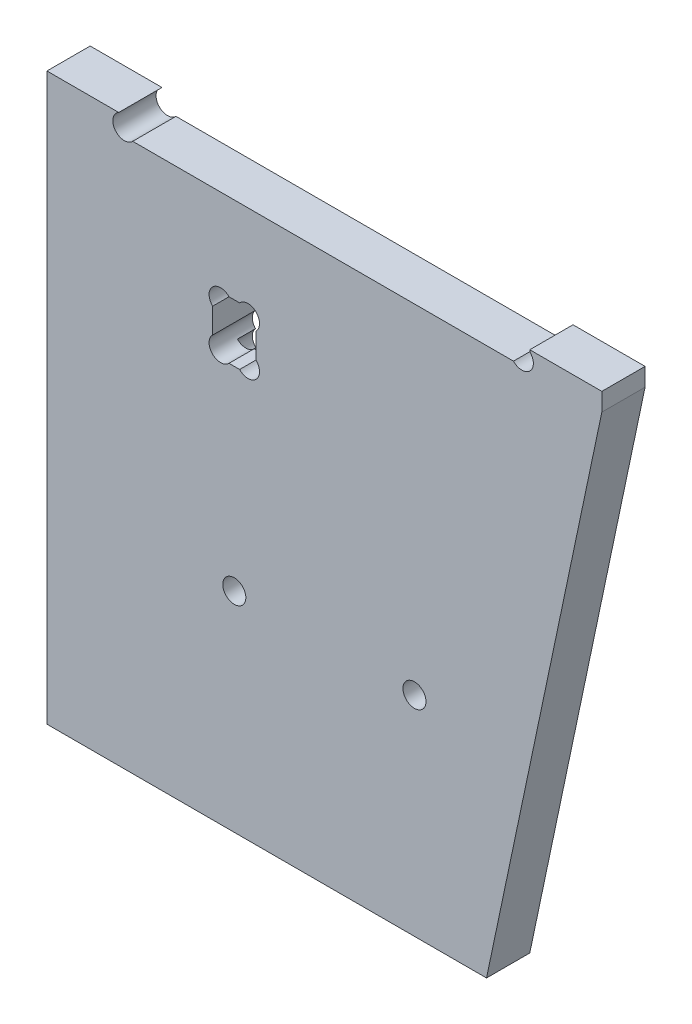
from build123d import *

# Parameters (mm, degrees)
BOSS_EXTRU_1_DEPTH      = 6
ESQUISSE5_R             = 1.6
ENL_V_MAT_EXTRU_3_DEPTH = 93.477024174
ENL_V_MAT_EXTRU_4_DEPTH = 2.5
ENL_V_MAT_EXTRU_5_DEPTH = 10
ESQUISSE8_W             = 106.811169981
ESQUISSE8_H             = 16.662542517
ENL_V_MAT_EXTRU_6_DEPTH = 10


with BuildPart() as part:
    # Esquisse2 → Boss.-Extru.1 (new body)
    with BuildSketch(Plane.XY):
        with BuildLine():
            Line((-31, 80), (-21, 80))
            Line((-21, 80), (-21, 76.517835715))
            ThreePointArc((-21, 76.517835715), (-21.534903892, 74.135152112), (-19.096659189, 74))
            Line((-19.096659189, 74), (33.738104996, 74))
            ThreePointArc((33.738104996, 74), (36.03137085, 73.96862915), (36, 76.261895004))
            Line((36, 76.261895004), (36, 80))
            Line((36, 80), (46, 80))
            Line((46, 80), (46, 74))
            Line((46, 74), (30, -2))
            Line((30, -2), (23, -2))
            Line((23, -2), (-6, -2))
            Line((-6, -2), (-31, -2))
            Line((-31, -2), (-31, 0))
            Line((-31, 0), (-31, 74))
            Line((-31, 74), (-31, 80))
        make_face()
    extrude(amount=-BOSS_EXTRU_1_DEPTH)

    # Esquisse5 → Enl_v. mat.-Extru.3 (cut, through all)
    with BuildSketch(Plane.XY):
        with Locations((-5, 27)):
            Circle(ESQUISSE5_R)
        with Locations((20, 27)):
            Circle(ESQUISSE5_R)
    extrude(amount=-ENL_V_MAT_EXTRU_3_DEPTH, mode=Mode.SUBTRACT)

    # Esquisse6 → Enl_v. mat.-Extru.4 (cut)
    with BuildSketch(Plane.XY.offset(-6)):
        with BuildLine():
            Line((-5.738104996, 54), (-4.261895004, 54))
            ThreePointArc((-4.261895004, 54), (-1.96862915, 54.03137085), (-2, 51.738104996))
            Line((-2, 51.738104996), (-2, 44.261895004))
            ThreePointArc((-2, 44.261895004), (-1.96862915, 41.96862915), (-4.261895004, 42))
            Line((-4.261895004, 42), (-5.738104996, 42))
            ThreePointArc((-5.738104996, 42), (-8.03137085, 41.96862915), (-8, 44.261895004))
            Line((-8, 44.261895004), (-8, 51.738104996))
            ThreePointArc((-8, 51.738104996), (-8.03137085, 54.03137085), (-5.738104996, 54))
        make_face()
        with BuildLine():
            Line((20.738104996, 54), (19.261895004, 54))
            ThreePointArc((19.261895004, 54), (16.96862915, 54.03137085), (17, 51.738104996))
            Line((17, 51.738104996), (17, 44.261895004))
            ThreePointArc((17, 44.261895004), (16.96862915, 41.96862915), (19.261895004, 42))
            Line((19.261895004, 42), (20.738104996, 42))
            ThreePointArc((20.738104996, 42), (23.03137085, 41.96862915), (23, 44.261895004))
            Line((23, 44.261895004), (23, 51.738104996))
            ThreePointArc((23, 51.738104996), (23.03137085, 54.03137085), (20.738104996, 54))
        make_face()
        with BuildLine():
            Line((19.261895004, 10), (20.738104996, 10))
            ThreePointArc((20.738104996, 10), (23.03137085, 10.03137085), (23, 7.738104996))
            Line((23, 7.738104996), (23, -2))
            Line((23, -2), (23, -4.5))
            Line((23, -4.5), (17, -4.5))
            Line((17, -4.5), (17, -2))
            Line((17, -2), (17, 7.738104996))
            ThreePointArc((17, 7.738104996), (16.96862915, 10.03137085), (19.261895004, 10))
        make_face()
        with BuildLine():
            Line((-2, 7.738104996), (-2, -2))
            Line((-2, -2), (-2, -4.5))
            Line((-2, -4.5), (-8, -4.5))
            Line((-8, -4.5), (-8, -2))
            Line((-8, -2), (-8, 7.738104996))
            ThreePointArc((-8, 7.738104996), (-8.03137085, 10.03137085), (-5.738104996, 10))
            Line((-5.738104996, 10), (-4.261895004, 10))
            ThreePointArc((-4.261895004, 10), (-1.96862915, 10.03137085), (-2, 7.738104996))
        make_face()
    extrude(amount=ENL_V_MAT_EXTRU_4_DEPTH, mode=Mode.SUBTRACT)

    # Esquisse7 → Enl_v. mat.-Extru.5 (cut)
    with BuildSketch(Plane.XY):
        with BuildLine():
            Line((-5.738104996, 62), (-4.261895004, 62))
            ThreePointArc((-4.261895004, 62), (-1.96862915, 62.03137085), (-2, 59.738104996))
            Line((-2, 59.738104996), (-2, 56.261895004))
            ThreePointArc((-2, 56.261895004), (-1.96862915, 53.96862915), (-4.261895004, 54))
            Line((-4.261895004, 54), (-5.738104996, 54))
            ThreePointArc((-5.738104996, 54), (-8.03137085, 53.96862915), (-8, 56.261895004))
            Line((-8, 56.261895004), (-8, 59.738104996))
            ThreePointArc((-8, 59.738104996), (-8.03137085, 62.03137085), (-5.738104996, 62))
        make_face()
    extrude(amount=-ENL_V_MAT_EXTRU_5_DEPTH, mode=Mode.SUBTRACT)

    # Esquisse8 → Enl_v. mat.-Extru.6 (cut)
    with BuildSketch(Plane(origin=(0, 0, -6), x_dir=(-1, 0, 0), z_dir=(0, 0, -1))):
        with Locations((-11.165371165, 84.831271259)):
            Rectangle(ESQUISSE8_W, ESQUISSE8_H)
    extrude(amount=-ENL_V_MAT_EXTRU_6_DEPTH, mode=Mode.SUBTRACT)


solid = part.part
